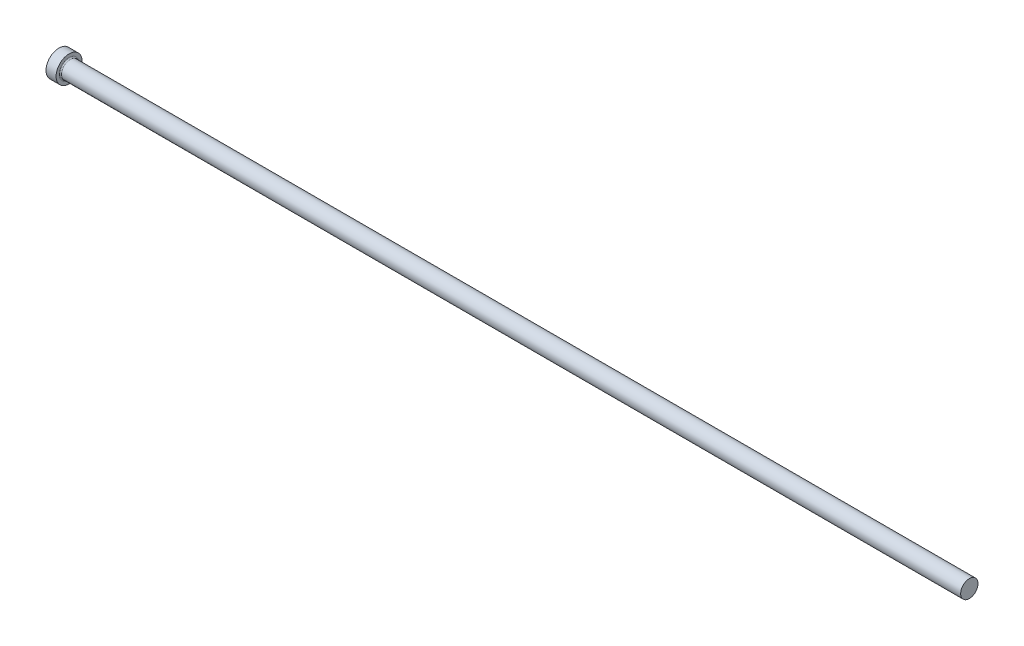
ISO-10303-21;
HEADER;
FILE_DESCRIPTION(('STEP AP214'),'2;1');
FILE_NAME('part.step','',(''),(''),'','','');
FILE_SCHEMA(('AUTOMOTIVE_DESIGN { 1 0 10303 214 1 1 1 1 }'));
ENDSEC;
DATA;
#1=APPLICATION_CONTEXT('core data for automotive mechanical design processes');
#2=APPLICATION_PROTOCOL_DEFINITION('international standard','automotive_design',2000,#1);
#3=PRODUCT_CONTEXT('',#1,'mechanical');
#4=PRODUCT('Part','Part','',(#3));
#5=PRODUCT_RELATED_PRODUCT_CATEGORY('part','',(#4));
#6=PRODUCT_DEFINITION_FORMATION('','',#4);
#7=PRODUCT_DEFINITION_CONTEXT('part definition',#1,'design');
#8=PRODUCT_DEFINITION('design','',#6,#7);
#9=PRODUCT_DEFINITION_SHAPE('','',#8);
#10=(LENGTH_UNIT() NAMED_UNIT(*) SI_UNIT(.MILLI.,.METRE.));
#11=(NAMED_UNIT(*) PLANE_ANGLE_UNIT() SI_UNIT($,.RADIAN.));
#12=(NAMED_UNIT(*) SI_UNIT($,.STERADIAN.) SOLID_ANGLE_UNIT());
#13=UNCERTAINTY_MEASURE_WITH_UNIT(LENGTH_MEASURE(1.E-05),#10,'distance_accuracy_value','');
#14=(GEOMETRIC_REPRESENTATION_CONTEXT(3) GLOBAL_UNCERTAINTY_ASSIGNED_CONTEXT((#13)) GLOBAL_UNIT_ASSIGNED_CONTEXT((#10,
#11,#12)) REPRESENTATION_CONTEXT('',''));
#15=CARTESIAN_POINT('',(0.,0.,0.));
#16=DIRECTION('',(0.,0.,1.));
#17=DIRECTION('',(1.,0.,0.));
#18=AXIS2_PLACEMENT_3D('',#15,#16,#17);
#19=CARTESIAN_POINT('',(0.,0.,0.));
#20=DIRECTION('',(-1.,0.,0.));
#21=DIRECTION('',(0.,-1.,0.));
#22=AXIS2_PLACEMENT_3D('',#19,#20,#21);
#23=PLANE('',#22);
#24=CARTESIAN_POINT('',(0.,0.,0.));
#25=DIRECTION('',(1.,0.,0.));
#26=DIRECTION('',(0.,1.,0.));
#27=AXIS2_PLACEMENT_3D('',#24,#25,#26);
#28=CIRCLE('',#27,9.);
#29=CARTESIAN_POINT('',(0.,9.,0.));
#30=VERTEX_POINT('',#29);
#31=EDGE_CURVE('E25',#30,#30,#28,.T.);
#32=ORIENTED_EDGE('',*,*,#31,.F.);
#33=EDGE_LOOP('',(#32));
#34=FACE_BOUND('',#33,.T.);
#35=ADVANCED_FACE('F14',(#34),#23,.T.);
#36=CARTESIAN_POINT('',(630.,0.,0.));
#37=DIRECTION('',(1.,0.,0.));
#38=DIRECTION('',(0.,1.,0.));
#39=AXIS2_PLACEMENT_3D('',#36,#37,#38);
#40=CYLINDRICAL_SURFACE('',#39,9.);
#41=ORIENTED_EDGE('',*,*,#31,.T.);
#42=EDGE_LOOP('',(#41));
#43=FACE_BOUND('',#42,.T.);
#44=CARTESIAN_POINT('',(7.,0.,0.));
#45=DIRECTION('',(1.,0.,0.));
#46=DIRECTION('',(0.,1.,0.));
#47=AXIS2_PLACEMENT_3D('',#44,#45,#46);
#48=CIRCLE('',#47,9.);
#49=CARTESIAN_POINT('',(7.,9.,0.));
#50=VERTEX_POINT('',#49);
#51=EDGE_CURVE('E29',#50,#50,#48,.T.);
#52=ORIENTED_EDGE('',*,*,#51,.F.);
#53=EDGE_LOOP('',(#52));
#54=FACE_BOUND('',#53,.T.);
#55=ADVANCED_FACE('F51',(#43,#54),#40,.T.);
#56=CARTESIAN_POINT('',(7.,9.,0.));
#57=DIRECTION('',(1.,0.,0.));
#58=DIRECTION('',(0.,1.,0.));
#59=AXIS2_PLACEMENT_3D('',#56,#57,#58);
#60=PLANE('',#59);
#61=CARTESIAN_POINT('',(7.,0.,0.));
#62=DIRECTION('',(1.,0.,0.));
#63=DIRECTION('',(0.,1.,0.));
#64=AXIS2_PLACEMENT_3D('',#61,#62,#63);
#65=CIRCLE('',#64,6.79999999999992);
#66=CARTESIAN_POINT('',(7.,6.79999999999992,0.));
#67=VERTEX_POINT('',#66);
#68=EDGE_CURVE('E9',#67,#67,#65,.F.);
#69=ORIENTED_EDGE('',*,*,#68,.T.);
#70=EDGE_LOOP('',(#69));
#71=FACE_BOUND('',#70,.T.);
#72=ORIENTED_EDGE('',*,*,#51,.T.);
#73=EDGE_LOOP('',(#72));
#74=FACE_BOUND('',#73,.T.);
#75=ADVANCED_FACE('F42',(#71,#74),#60,.T.);
#76=CARTESIAN_POINT('',(630.,0.,0.));
#77=DIRECTION('',(1.,0.,0.));
#78=DIRECTION('',(0.,1.,0.));
#79=AXIS2_PLACEMENT_3D('',#76,#77,#78);
#80=CYLINDRICAL_SURFACE('',#79,5.99999999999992);
#81=CARTESIAN_POINT('',(7.8,0.,0.));
#82=DIRECTION('',(1.,0.,0.));
#83=DIRECTION('',(0.,1.,0.));
#84=AXIS2_PLACEMENT_3D('',#81,#82,#83);
#85=CIRCLE('',#84,5.99999999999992);
#86=CARTESIAN_POINT('',(7.8,5.99999999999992,0.));
#87=VERTEX_POINT('',#86);
#88=EDGE_CURVE('E21',#87,#87,#85,.T.);
#89=ORIENTED_EDGE('',*,*,#88,.T.);
#90=EDGE_LOOP('',(#89));
#91=FACE_BOUND('',#90,.T.);
#92=CARTESIAN_POINT('',(630.,0.,0.));
#93=DIRECTION('',(1.,0.,0.));
#94=DIRECTION('',(0.,1.,0.));
#95=AXIS2_PLACEMENT_3D('',#92,#93,#94);
#96=CIRCLE('',#95,5.99999999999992);
#97=CARTESIAN_POINT('',(630.,5.99999999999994,0.));
#98=VERTEX_POINT('',#97);
#99=EDGE_CURVE('E34',#98,#98,#96,.T.);
#100=ORIENTED_EDGE('',*,*,#99,.F.);
#101=EDGE_LOOP('',(#100));
#102=FACE_BOUND('',#101,.T.);
#103=ADVANCED_FACE('F40',(#91,#102),#80,.T.);
#104=CARTESIAN_POINT('',(630.,6.,0.));
#105=DIRECTION('',(1.,0.,0.));
#106=DIRECTION('',(0.,1.,0.));
#107=AXIS2_PLACEMENT_3D('',#104,#105,#106);
#108=PLANE('',#107);
#109=ORIENTED_EDGE('',*,*,#99,.T.);
#110=EDGE_LOOP('',(#109));
#111=FACE_BOUND('',#110,.T.);
#112=ADVANCED_FACE('F38',(#111),#108,.T.);
#113=CARTESIAN_POINT('',(7.8,0.,0.));
#114=DIRECTION('',(1.,0.,0.));
#115=DIRECTION('',(0.,1.,0.));
#116=AXIS2_PLACEMENT_3D('',#113,#114,#115);
#117=TOROIDAL_SURFACE('',#116,6.79999999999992,0.8);
#118=ORIENTED_EDGE('',*,*,#68,.F.);
#119=EDGE_LOOP('',(#118));
#120=FACE_BOUND('',#119,.T.);
#121=ORIENTED_EDGE('',*,*,#88,.F.);
#122=EDGE_LOOP('',(#121));
#123=FACE_BOUND('',#122,.T.);
#124=ADVANCED_FACE('F16',(#120,#123),#117,.F.);
#125=CLOSED_SHELL('',(#35,#55,#75,#103,#112,#124));
#126=MANIFOLD_SOLID_BREP('B1',#125);
#127=ADVANCED_BREP_SHAPE_REPRESENTATION('',(#18,#126),#14);
#128=SHAPE_DEFINITION_REPRESENTATION(#9,#127);
ENDSEC;
END-ISO-10303-21;
